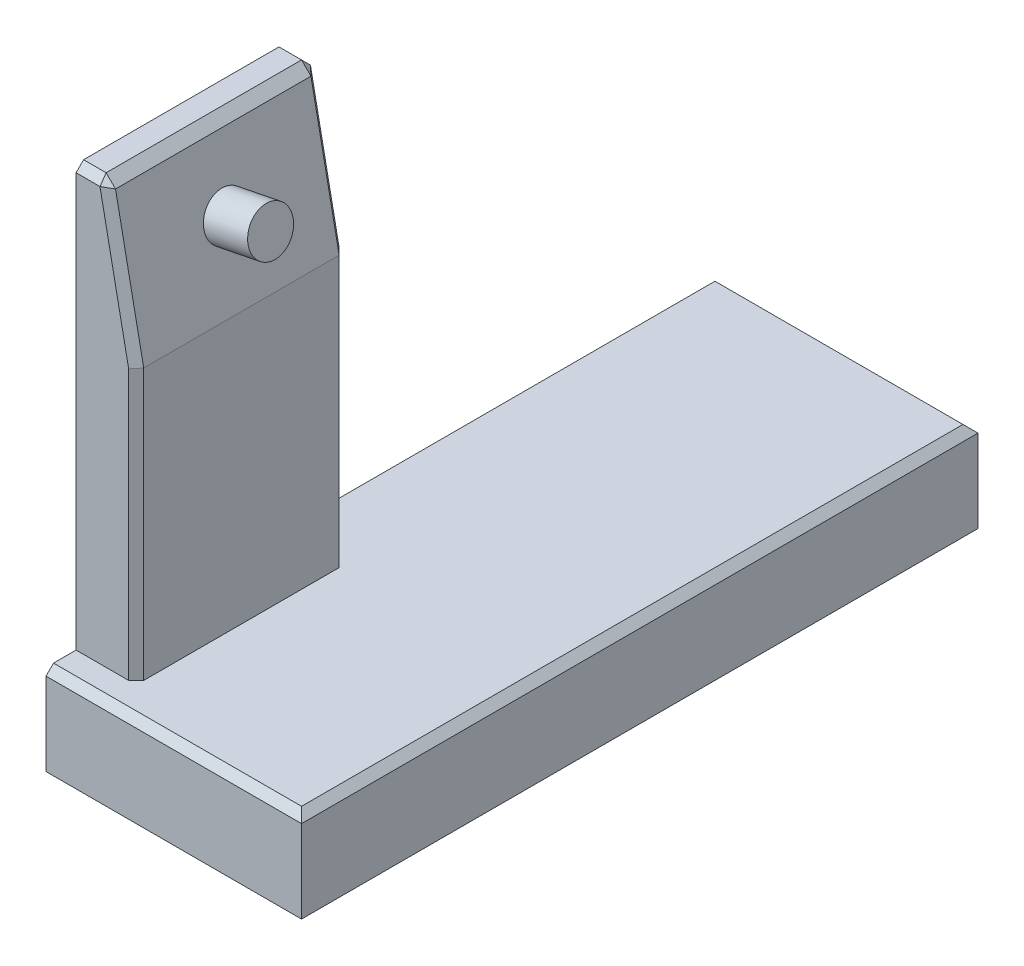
ISO-10303-21;
HEADER;
FILE_DESCRIPTION(('STEP AP214'),'2;1');
FILE_NAME('part.step','',(''),(''),'','','');
FILE_SCHEMA(('AUTOMOTIVE_DESIGN { 1 0 10303 214 1 1 1 1 }'));
ENDSEC;
DATA;
#1=APPLICATION_CONTEXT('core data for automotive mechanical design processes');
#2=APPLICATION_PROTOCOL_DEFINITION('international standard','automotive_design',2000,#1);
#3=PRODUCT_CONTEXT('',#1,'mechanical');
#4=PRODUCT('Part','Part','',(#3));
#5=PRODUCT_RELATED_PRODUCT_CATEGORY('part','',(#4));
#6=PRODUCT_DEFINITION_FORMATION('','',#4);
#7=PRODUCT_DEFINITION_CONTEXT('part definition',#1,'design');
#8=PRODUCT_DEFINITION('design','',#6,#7);
#9=PRODUCT_DEFINITION_SHAPE('','',#8);
#10=(LENGTH_UNIT() NAMED_UNIT(*) SI_UNIT(.MILLI.,.METRE.));
#11=(NAMED_UNIT(*) PLANE_ANGLE_UNIT() SI_UNIT($,.RADIAN.));
#12=(NAMED_UNIT(*) SI_UNIT($,.STERADIAN.) SOLID_ANGLE_UNIT());
#13=UNCERTAINTY_MEASURE_WITH_UNIT(LENGTH_MEASURE(1.E-05),#10,'distance_accuracy_value','');
#14=(GEOMETRIC_REPRESENTATION_CONTEXT(3) GLOBAL_UNCERTAINTY_ASSIGNED_CONTEXT((#13)) GLOBAL_UNIT_ASSIGNED_CONTEXT((#10,
#11,#12)) REPRESENTATION_CONTEXT('',''));
#15=CARTESIAN_POINT('',(0.,0.,0.));
#16=DIRECTION('',(0.,0.,1.));
#17=DIRECTION('',(1.,0.,0.));
#18=AXIS2_PLACEMENT_3D('',#15,#16,#17);
#19=CARTESIAN_POINT('',(0.,6.,0.));
#20=DIRECTION('',(0.,-1.,0.));
#21=DIRECTION('',(0.,0.,-1.));
#22=AXIS2_PLACEMENT_3D('',#19,#20,#21);
#23=PLANE('',#22);
#24=DIRECTION('',(0.,0.,1.));
#25=VECTOR('',#24,1.);
#26=CARTESIAN_POINT('',(0.,6.,0.));
#27=LINE('',#26,#25);
#28=CARTESIAN_POINT('',(0.,6.,-2.));
#29=VERTEX_POINT('',#28);
#30=CARTESIAN_POINT('',(0.,6.,-0.5));
#31=VERTEX_POINT('',#30);
#32=EDGE_CURVE('E183',#29,#31,#27,.T.);
#33=ORIENTED_EDGE('',*,*,#32,.T.);
#34=DIRECTION('',(1.,0.,0.));
#35=VECTOR('',#34,1.);
#36=CARTESIAN_POINT('',(0.,6.,-0.5));
#37=LINE('',#36,#35);
#38=CARTESIAN_POINT('',(16.5,6.,-0.5));
#39=VERTEX_POINT('',#38);
#40=EDGE_CURVE('E229',#31,#39,#37,.T.);
#41=ORIENTED_EDGE('',*,*,#40,.T.);
#42=DIRECTION('',(0.,0.,-1.));
#43=VECTOR('',#42,1.);
#44=CARTESIAN_POINT('',(16.5,6.,0.));
#45=LINE('',#44,#43);
#46=CARTESIAN_POINT('',(16.5,6.,-44.5));
#47=VERTEX_POINT('',#46);
#48=EDGE_CURVE('E225',#39,#47,#45,.T.);
#49=ORIENTED_EDGE('',*,*,#48,.T.);
#50=DIRECTION('',(-1.,0.,0.));
#51=VECTOR('',#50,1.);
#52=CARTESIAN_POINT('',(0.,6.,-44.5));
#53=LINE('',#52,#51);
#54=CARTESIAN_POINT('',(0.,6.,-44.5));
#55=VERTEX_POINT('',#54);
#56=EDGE_CURVE('E227',#47,#55,#53,.T.);
#57=ORIENTED_EDGE('',*,*,#56,.T.);
#58=CARTESIAN_POINT('',(0.,6.,-16.));
#59=VERTEX_POINT('',#58);
#60=EDGE_CURVE('E178',#55,#59,#27,.T.);
#61=ORIENTED_EDGE('',*,*,#60,.T.);
#62=DIRECTION('',(-1.,0.,0.));
#63=VECTOR('',#62,1.);
#64=CARTESIAN_POINT('',(0.,6.,-16.));
#65=LINE('',#64,#63);
#66=CARTESIAN_POINT('',(3.5,6.,-16.));
#67=VERTEX_POINT('',#66);
#68=EDGE_CURVE('E361',#67,#59,#65,.T.);
#69=ORIENTED_EDGE('',*,*,#68,.F.);
#70=DIRECTION('',(-0.707106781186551,0.,-0.707106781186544));
#71=VECTOR('',#70,1.);
#72=CARTESIAN_POINT('',(9.74999999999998,6.,-9.75000000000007));
#73=LINE('',#72,#71);
#74=CARTESIAN_POINT('',(4.,6.,-15.5));
#75=VERTEX_POINT('',#74);
#76=EDGE_CURVE('E42',#67,#75,#73,.F.);
#77=ORIENTED_EDGE('',*,*,#76,.T.);
#78=DIRECTION('',(0.,0.,-1.));
#79=VECTOR('',#78,1.);
#80=CARTESIAN_POINT('',(4.,6.,-2.));
#81=LINE('',#80,#79);
#82=CARTESIAN_POINT('',(4.,6.,-2.49999999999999));
#83=VERTEX_POINT('',#82);
#84=EDGE_CURVE('E359',#83,#75,#81,.T.);
#85=ORIENTED_EDGE('',*,*,#84,.F.);
#86=DIRECTION('',(0.707106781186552,0.,-0.707106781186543));
#87=VECTOR('',#86,1.);
#88=CARTESIAN_POINT('',(0.749999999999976,6.,0.749999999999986));
#89=LINE('',#88,#87);
#90=CARTESIAN_POINT('',(3.5,6.,-2.));
#91=VERTEX_POINT('',#90);
#92=EDGE_CURVE('E11',#83,#91,#89,.F.);
#93=ORIENTED_EDGE('',*,*,#92,.T.);
#94=DIRECTION('',(1.,0.,0.));
#95=VECTOR('',#94,1.);
#96=CARTESIAN_POINT('',(0.,6.,-2.));
#97=LINE('',#96,#95);
#98=EDGE_CURVE('E281',#29,#91,#97,.T.);
#99=ORIENTED_EDGE('',*,*,#98,.F.);
#100=EDGE_LOOP('',(#33,#41,#49,#57,#61,#69,#77,#85,#93,#99));
#101=FACE_BOUND('',#100,.T.);
#102=ADVANCED_FACE('F33',(#101),#23,.F.);
#103=CARTESIAN_POINT('',(0.,6.,0.));
#104=DIRECTION('',(1.,0.,0.));
#105=DIRECTION('',(0.,0.,-1.));
#106=AXIS2_PLACEMENT_3D('',#103,#104,#105);
#107=PLANE('',#106);
#108=DIRECTION('',(0.,0.,1.));
#109=VECTOR('',#108,1.);
#110=CARTESIAN_POINT('',(0.,34.,-2.));
#111=LINE('',#110,#109);
#112=CARTESIAN_POINT('',(0.,34.,-15.5));
#113=VERTEX_POINT('',#112);
#114=CARTESIAN_POINT('',(0.,34.,-2.49999999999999));
#115=VERTEX_POINT('',#114);
#116=EDGE_CURVE('E368',#113,#115,#111,.T.);
#117=ORIENTED_EDGE('',*,*,#116,.F.);
#118=DIRECTION('',(0.,0.707106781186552,0.707106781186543));
#119=VECTOR('',#118,1.);
#120=CARTESIAN_POINT('',(0.,34.,-15.5));
#121=LINE('',#120,#119);
#122=CARTESIAN_POINT('',(0.,33.5,-16.));
#123=VERTEX_POINT('',#122);
#124=EDGE_CURVE('E207',#113,#123,#121,.F.);
#125=ORIENTED_EDGE('',*,*,#124,.T.);
#126=DIRECTION('',(0.,-1.,0.));
#127=VECTOR('',#126,1.);
#128=CARTESIAN_POINT('',(0.,34.,-16.));
#129=LINE('',#128,#127);
#130=EDGE_CURVE('E175',#123,#59,#129,.T.);
#131=ORIENTED_EDGE('',*,*,#130,.T.);
#132=ORIENTED_EDGE('',*,*,#60,.F.);
#133=DIRECTION('',(0.,0.707106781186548,0.707106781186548));
#134=VECTOR('',#133,1.);
#135=CARTESIAN_POINT('',(0.,6.,-44.5));
#136=LINE('',#135,#134);
#137=CARTESIAN_POINT('',(0.,5.5,-45.));
#138=VERTEX_POINT('',#137);
#139=EDGE_CURVE('E201',#55,#138,#136,.F.);
#140=ORIENTED_EDGE('',*,*,#139,.T.);
#141=DIRECTION('',(0.,-1.,0.));
#142=VECTOR('',#141,1.);
#143=CARTESIAN_POINT('',(0.,6.,-45.));
#144=LINE('',#143,#142);
#145=CARTESIAN_POINT('',(0.,0.,-45.));
#146=VERTEX_POINT('',#145);
#147=EDGE_CURVE('E171',#138,#146,#144,.T.);
#148=ORIENTED_EDGE('',*,*,#147,.T.);
#149=DIRECTION('',(0.,0.,1.));
#150=VECTOR('',#149,1.);
#151=CARTESIAN_POINT('',(0.,0.,0.));
#152=LINE('',#151,#150);
#153=CARTESIAN_POINT('',(0.,0.,0.));
#154=VERTEX_POINT('',#153);
#155=EDGE_CURVE('E165',#146,#154,#152,.T.);
#156=ORIENTED_EDGE('',*,*,#155,.T.);
#157=DIRECTION('',(0.,-1.,0.));
#158=VECTOR('',#157,1.);
#159=CARTESIAN_POINT('',(0.,6.,0.));
#160=LINE('',#159,#158);
#161=CARTESIAN_POINT('',(0.,5.5,0.));
#162=VERTEX_POINT('',#161);
#163=EDGE_CURVE('E148',#162,#154,#160,.T.);
#164=ORIENTED_EDGE('',*,*,#163,.F.);
#165=DIRECTION('',(0.,-0.707106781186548,0.707106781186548));
#166=VECTOR('',#165,1.);
#167=CARTESIAN_POINT('',(0.,6.,-0.5));
#168=LINE('',#167,#166);
#169=EDGE_CURVE('E203',#162,#31,#168,.F.);
#170=ORIENTED_EDGE('',*,*,#169,.T.);
#171=ORIENTED_EDGE('',*,*,#32,.F.);
#172=DIRECTION('',(0.,-1.,0.));
#173=VECTOR('',#172,1.);
#174=CARTESIAN_POINT('',(0.,34.,-2.));
#175=LINE('',#174,#173);
#176=CARTESIAN_POINT('',(0.,33.5,-2.));
#177=VERTEX_POINT('',#176);
#178=EDGE_CURVE('E173',#177,#29,#175,.T.);
#179=ORIENTED_EDGE('',*,*,#178,.F.);
#180=DIRECTION('',(0.,-0.707106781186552,0.707106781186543));
#181=VECTOR('',#180,1.);
#182=CARTESIAN_POINT('',(0.,34.,-2.49999999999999));
#183=LINE('',#182,#181);
#184=EDGE_CURVE('E205',#177,#115,#183,.F.);
#185=ORIENTED_EDGE('',*,*,#184,.T.);
#186=EDGE_LOOP('',(#117,#125,#131,#132,#140,#148,#156,#164,#170,#171,#179,#185));
#187=FACE_BOUND('',#186,.T.);
#188=ADVANCED_FACE('F170',(#187),#107,.F.);
#189=CARTESIAN_POINT('',(0.,6.,0.));
#190=DIRECTION('',(0.,0.,-1.));
#191=DIRECTION('',(-1.,0.,0.));
#192=AXIS2_PLACEMENT_3D('',#189,#190,#191);
#193=PLANE('',#192);
#194=DIRECTION('',(0.,-1.,0.));
#195=VECTOR('',#194,1.);
#196=CARTESIAN_POINT('',(17.,6.,0.));
#197=LINE('',#196,#195);
#198=CARTESIAN_POINT('',(17.,5.5,0.));
#199=VERTEX_POINT('',#198);
#200=CARTESIAN_POINT('',(17.,0.,0.));
#201=VERTEX_POINT('',#200);
#202=EDGE_CURVE('E159',#199,#201,#197,.T.);
#203=ORIENTED_EDGE('',*,*,#202,.F.);
#204=DIRECTION('',(-1.,0.,0.));
#205=VECTOR('',#204,1.);
#206=CARTESIAN_POINT('',(0.,5.5,0.));
#207=LINE('',#206,#205);
#208=EDGE_CURVE('E154',#199,#162,#207,.T.);
#209=ORIENTED_EDGE('',*,*,#208,.T.);
#210=ORIENTED_EDGE('',*,*,#163,.T.);
#211=DIRECTION('',(1.,0.,0.));
#212=VECTOR('',#211,1.);
#213=CARTESIAN_POINT('',(0.,0.,0.));
#214=LINE('',#213,#212);
#215=EDGE_CURVE('E151',#154,#201,#214,.T.);
#216=ORIENTED_EDGE('',*,*,#215,.T.);
#217=EDGE_LOOP('',(#203,#209,#210,#216));
#218=FACE_BOUND('',#217,.T.);
#219=ADVANCED_FACE('F150',(#218),#193,.F.);
#220=CARTESIAN_POINT('',(17.,6.,0.));
#221=DIRECTION('',(-1.,0.,0.));
#222=DIRECTION('',(0.,0.,1.));
#223=AXIS2_PLACEMENT_3D('',#220,#221,#222);
#224=PLANE('',#223);
#225=DIRECTION('',(0.,-1.,0.));
#226=VECTOR('',#225,1.);
#227=CARTESIAN_POINT('',(17.,6.,-45.));
#228=LINE('',#227,#226);
#229=CARTESIAN_POINT('',(17.,5.5,-45.));
#230=VERTEX_POINT('',#229);
#231=CARTESIAN_POINT('',(17.,0.,-45.));
#232=VERTEX_POINT('',#231);
#233=EDGE_CURVE('E185',#230,#232,#228,.T.);
#234=ORIENTED_EDGE('',*,*,#233,.F.);
#235=DIRECTION('',(0.,0.,1.));
#236=VECTOR('',#235,1.);
#237=CARTESIAN_POINT('',(17.,5.5,0.));
#238=LINE('',#237,#236);
#239=EDGE_CURVE('E57',#230,#199,#238,.T.);
#240=ORIENTED_EDGE('',*,*,#239,.T.);
#241=ORIENTED_EDGE('',*,*,#202,.T.);
#242=DIRECTION('',(0.,0.,-1.));
#243=VECTOR('',#242,1.);
#244=CARTESIAN_POINT('',(17.,0.,0.));
#245=LINE('',#244,#243);
#246=EDGE_CURVE('E167',#201,#232,#245,.T.);
#247=ORIENTED_EDGE('',*,*,#246,.T.);
#248=EDGE_LOOP('',(#234,#240,#241,#247));
#249=FACE_BOUND('',#248,.T.);
#250=ADVANCED_FACE('F307',(#249),#224,.F.);
#251=CARTESIAN_POINT('',(0.,6.,-45.));
#252=DIRECTION('',(0.,0.,1.));
#253=DIRECTION('',(1.,0.,0.));
#254=AXIS2_PLACEMENT_3D('',#251,#252,#253);
#255=PLANE('',#254);
#256=ORIENTED_EDGE('',*,*,#147,.F.);
#257=DIRECTION('',(1.,0.,0.));
#258=VECTOR('',#257,1.);
#259=CARTESIAN_POINT('',(0.,5.5,-45.));
#260=LINE('',#259,#258);
#261=EDGE_CURVE('E50',#138,#230,#260,.T.);
#262=ORIENTED_EDGE('',*,*,#261,.T.);
#263=ORIENTED_EDGE('',*,*,#233,.T.);
#264=DIRECTION('',(-1.,0.,0.));
#265=VECTOR('',#264,1.);
#266=CARTESIAN_POINT('',(0.,0.,-45.));
#267=LINE('',#266,#265);
#268=EDGE_CURVE('E181',#232,#146,#267,.T.);
#269=ORIENTED_EDGE('',*,*,#268,.T.);
#270=EDGE_LOOP('',(#256,#262,#263,#269));
#271=FACE_BOUND('',#270,.T.);
#272=ADVANCED_FACE('F303',(#271),#255,.F.);
#273=CARTESIAN_POINT('',(0.,0.,0.));
#274=DIRECTION('',(0.,-1.,0.));
#275=DIRECTION('',(0.,0.,-1.));
#276=AXIS2_PLACEMENT_3D('',#273,#274,#275);
#277=PLANE('',#276);
#278=CARTESIAN_POINT('',(9.,0.,-11.25));
#279=DIRECTION('',(0.,-1.,0.));
#280=DIRECTION('',(0.,0.,-1.));
#281=AXIS2_PLACEMENT_3D('',#278,#279,#280);
#282=CIRCLE('',#281,4.);
#283=CARTESIAN_POINT('',(9.,0.,-15.25));
#284=VERTEX_POINT('',#283);
#285=EDGE_CURVE('E386',#284,#284,#282,.T.);
#286=ORIENTED_EDGE('',*,*,#285,.F.);
#287=EDGE_LOOP('',(#286));
#288=FACE_BOUND('',#287,.T.);
#289=CARTESIAN_POINT('',(9.00000000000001,0.,-33.75));
#290=DIRECTION('',(0.,-1.,0.));
#291=DIRECTION('',(0.,0.,-1.));
#292=AXIS2_PLACEMENT_3D('',#289,#290,#291);
#293=CIRCLE('',#292,4.);
#294=CARTESIAN_POINT('',(9.00000000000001,0.,-37.75));
#295=VERTEX_POINT('',#294);
#296=EDGE_CURVE('E380',#295,#295,#293,.T.);
#297=ORIENTED_EDGE('',*,*,#296,.F.);
#298=EDGE_LOOP('',(#297));
#299=FACE_BOUND('',#298,.T.);
#300=ORIENTED_EDGE('',*,*,#155,.F.);
#301=ORIENTED_EDGE('',*,*,#268,.F.);
#302=ORIENTED_EDGE('',*,*,#246,.F.);
#303=ORIENTED_EDGE('',*,*,#215,.F.);
#304=EDGE_LOOP('',(#300,#301,#302,#303));
#305=FACE_BOUND('',#304,.T.);
#306=ADVANCED_FACE('F163',(#288,#299,#305),#277,.T.);
#307=CARTESIAN_POINT('',(0.,34.,-2.));
#308=DIRECTION('',(0.,0.,-1.));
#309=DIRECTION('',(-1.,0.,0.));
#310=AXIS2_PLACEMENT_3D('',#307,#308,#309);
#311=PLANE('',#310);
#312=DIRECTION('',(-0.196116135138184,0.98058067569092,0.));
#313=VECTOR('',#312,1.);
#314=CARTESIAN_POINT('',(1.43278658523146,34.2865573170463,-2.));
#315=LINE('',#314,#313);
#316=CARTESIAN_POINT('',(3.5,23.9504902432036,-2.));
#317=VERTEX_POINT('',#316);
#318=CARTESIAN_POINT('',(1.59009804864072,33.5,-2.));
#319=VERTEX_POINT('',#318);
#320=EDGE_CURVE('E221',#317,#319,#315,.T.);
#321=ORIENTED_EDGE('',*,*,#320,.T.);
#322=DIRECTION('',(-1.,0.,0.));
#323=VECTOR('',#322,1.);
#324=CARTESIAN_POINT('',(0.,33.5,-2.));
#325=LINE('',#324,#323);
#326=EDGE_CURVE('E223',#319,#177,#325,.T.);
#327=ORIENTED_EDGE('',*,*,#326,.T.);
#328=ORIENTED_EDGE('',*,*,#178,.T.);
#329=ORIENTED_EDGE('',*,*,#98,.T.);
#330=DIRECTION('',(0.,1.,0.));
#331=VECTOR('',#330,1.);
#332=CARTESIAN_POINT('',(3.5,34.,-2.));
#333=LINE('',#332,#331);
#334=EDGE_CURVE('E219',#91,#317,#333,.T.);
#335=ORIENTED_EDGE('',*,*,#334,.T.);
#336=EDGE_LOOP('',(#321,#327,#328,#329,#335));
#337=FACE_BOUND('',#336,.T.);
#338=ADVANCED_FACE('F299',(#337),#311,.F.);
#339=CARTESIAN_POINT('',(4.,34.,-2.));
#340=DIRECTION('',(-1.,0.,0.));
#341=DIRECTION('',(0.,0.,1.));
#342=AXIS2_PLACEMENT_3D('',#339,#340,#341);
#343=PLANE('',#342);
#344=ORIENTED_EDGE('',*,*,#84,.T.);
#345=DIRECTION('',(0.,1.,0.));
#346=VECTOR('',#345,1.);
#347=CARTESIAN_POINT('',(4.,34.,-15.5));
#348=LINE('',#347,#346);
#349=CARTESIAN_POINT('',(4.,24.,-15.5));
#350=VERTEX_POINT('',#349);
#351=EDGE_CURVE('E217',#75,#350,#348,.T.);
#352=ORIENTED_EDGE('',*,*,#351,.T.);
#353=DIRECTION('',(0.,0.,1.));
#354=VECTOR('',#353,1.);
#355=CARTESIAN_POINT('',(4.,24.,-16.));
#356=LINE('',#355,#354);
#357=CARTESIAN_POINT('',(4.,24.,-2.49999999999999));
#358=VERTEX_POINT('',#357);
#359=EDGE_CURVE('E370',#350,#358,#356,.T.);
#360=ORIENTED_EDGE('',*,*,#359,.T.);
#361=DIRECTION('',(0.,-1.,0.));
#362=VECTOR('',#361,1.);
#363=CARTESIAN_POINT('',(4.,34.,-2.49999999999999));
#364=LINE('',#363,#362);
#365=EDGE_CURVE('E215',#358,#83,#364,.T.);
#366=ORIENTED_EDGE('',*,*,#365,.T.);
#367=EDGE_LOOP('',(#344,#352,#360,#366));
#368=FACE_BOUND('',#367,.T.);
#369=ADVANCED_FACE('F363',(#368),#343,.F.);
#370=CARTESIAN_POINT('',(0.,34.,-16.));
#371=DIRECTION('',(0.,0.,1.));
#372=DIRECTION('',(1.,0.,0.));
#373=AXIS2_PLACEMENT_3D('',#370,#371,#372);
#374=PLANE('',#373);
#375=ORIENTED_EDGE('',*,*,#130,.F.);
#376=DIRECTION('',(1.,0.,0.));
#377=VECTOR('',#376,1.);
#378=CARTESIAN_POINT('',(0.,33.5,-16.));
#379=LINE('',#378,#377);
#380=CARTESIAN_POINT('',(1.59009804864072,33.5,-16.));
#381=VERTEX_POINT('',#380);
#382=EDGE_CURVE('E213',#123,#381,#379,.T.);
#383=ORIENTED_EDGE('',*,*,#382,.T.);
#384=DIRECTION('',(0.196116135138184,-0.98058067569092,0.));
#385=VECTOR('',#384,1.);
#386=CARTESIAN_POINT('',(1.43278658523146,34.2865573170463,-16.));
#387=LINE('',#386,#385);
#388=CARTESIAN_POINT('',(3.49999999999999,23.9504902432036,-16.));
#389=VERTEX_POINT('',#388);
#390=EDGE_CURVE('E209',#381,#389,#387,.T.);
#391=ORIENTED_EDGE('',*,*,#390,.T.);
#392=DIRECTION('',(0.,-1.,0.));
#393=VECTOR('',#392,1.);
#394=CARTESIAN_POINT('',(3.5,34.,-16.));
#395=LINE('',#394,#393);
#396=EDGE_CURVE('E211',#389,#67,#395,.T.);
#397=ORIENTED_EDGE('',*,*,#396,.T.);
#398=ORIENTED_EDGE('',*,*,#68,.T.);
#399=EDGE_LOOP('',(#375,#383,#391,#397,#398));
#400=FACE_BOUND('',#399,.T.);
#401=ADVANCED_FACE('F429',(#400),#374,.F.);
#402=CARTESIAN_POINT('',(0.,34.,0.));
#403=DIRECTION('',(0.,-1.,0.));
#404=DIRECTION('',(0.,0.,-1.));
#405=AXIS2_PLACEMENT_3D('',#402,#403,#404);
#406=PLANE('',#405);
#407=DIRECTION('',(0.,0.,-1.));
#408=VECTOR('',#407,1.);
#409=CARTESIAN_POINT('',(1.50000000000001,34.,0.));
#410=LINE('',#409,#408);
#411=CARTESIAN_POINT('',(1.50000000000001,34.,-2.49999999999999));
#412=VERTEX_POINT('',#411);
#413=CARTESIAN_POINT('',(1.50000000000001,34.,-15.5));
#414=VERTEX_POINT('',#413);
#415=EDGE_CURVE('E197',#412,#414,#410,.T.);
#416=ORIENTED_EDGE('',*,*,#415,.T.);
#417=DIRECTION('',(-1.,0.,0.));
#418=VECTOR('',#417,1.);
#419=CARTESIAN_POINT('',(0.,34.,-15.5));
#420=LINE('',#419,#418);
#421=EDGE_CURVE('E199',#414,#113,#420,.T.);
#422=ORIENTED_EDGE('',*,*,#421,.T.);
#423=ORIENTED_EDGE('',*,*,#116,.T.);
#424=DIRECTION('',(1.,0.,0.));
#425=VECTOR('',#424,1.);
#426=CARTESIAN_POINT('',(0.,34.,-2.49999999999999));
#427=LINE('',#426,#425);
#428=EDGE_CURVE('E195',#115,#412,#427,.T.);
#429=ORIENTED_EDGE('',*,*,#428,.T.);
#430=EDGE_LOOP('',(#416,#422,#423,#429));
#431=FACE_BOUND('',#430,.T.);
#432=ADVANCED_FACE('F406',(#431),#406,.F.);
#433=CARTESIAN_POINT('',(2.,34.,-16.));
#434=DIRECTION('',(-0.98058067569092,-0.196116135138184,0.));
#435=DIRECTION('',(0.196116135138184,-0.98058067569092,0.));
#436=AXIS2_PLACEMENT_3D('',#433,#434,#435);
#437=PLANE('',#436);
#438=CARTESIAN_POINT('',(3.,29.,-9.));
#439=DIRECTION('',(0.98058067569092,0.196116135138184,0.));
#440=DIRECTION('',(-0.196116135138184,0.98058067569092,0.));
#441=AXIS2_PLACEMENT_3D('',#438,#439,#440);
#442=CIRCLE('',#441,1.5);
#443=CARTESIAN_POINT('',(2.70582579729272,30.4708710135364,-9.));
#444=VERTEX_POINT('',#443);
#445=EDGE_CURVE('E158',#444,#444,#442,.T.);
#446=ORIENTED_EDGE('',*,*,#445,.F.);
#447=EDGE_LOOP('',(#446));
#448=FACE_BOUND('',#447,.T.);
#449=ORIENTED_EDGE('',*,*,#359,.F.);
#450=DIRECTION('',(-0.196116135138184,0.98058067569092,0.));
#451=VECTOR('',#450,1.);
#452=CARTESIAN_POINT('',(2.,34.,-15.5));
#453=LINE('',#452,#451);
#454=CARTESIAN_POINT('',(2.125,33.375,-15.5));
#455=VERTEX_POINT('',#454);
#456=EDGE_CURVE('E193',#350,#455,#453,.T.);
#457=ORIENTED_EDGE('',*,*,#456,.T.);
#458=DIRECTION('',(0.,0.,1.));
#459=VECTOR('',#458,1.);
#460=CARTESIAN_POINT('',(2.125,33.375,-16.));
#461=LINE('',#460,#459);
#462=CARTESIAN_POINT('',(2.125,33.375,-2.49999999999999));
#463=VERTEX_POINT('',#462);
#464=EDGE_CURVE('E190',#455,#463,#461,.T.);
#465=ORIENTED_EDGE('',*,*,#464,.T.);
#466=DIRECTION('',(0.196116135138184,-0.98058067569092,0.));
#467=VECTOR('',#466,1.);
#468=CARTESIAN_POINT('',(2.,34.,-2.49999999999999));
#469=LINE('',#468,#467);
#470=EDGE_CURVE('E188',#463,#358,#469,.T.);
#471=ORIENTED_EDGE('',*,*,#470,.T.);
#472=EDGE_LOOP('',(#449,#457,#465,#471));
#473=FACE_BOUND('',#472,.T.);
#474=ADVANCED_FACE('F402',(#448,#473),#437,.F.);
#475=CARTESIAN_POINT('',(9.00000000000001,5.,-33.75));
#476=DIRECTION('',(0.,-1.,0.));
#477=DIRECTION('',(0.,0.,-1.));
#478=AXIS2_PLACEMENT_3D('',#475,#476,#477);
#479=CYLINDRICAL_SURFACE('',#478,4.);
#480=CARTESIAN_POINT('',(9.00000000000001,5.,-33.75));
#481=DIRECTION('',(0.,-1.,0.));
#482=DIRECTION('',(0.,0.,-1.));
#483=AXIS2_PLACEMENT_3D('',#480,#481,#482);
#484=CIRCLE('',#483,4.);
#485=CARTESIAN_POINT('',(9.00000000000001,5.,-37.75));
#486=VERTEX_POINT('',#485);
#487=EDGE_CURVE('E383',#486,#486,#484,.T.);
#488=ORIENTED_EDGE('',*,*,#487,.F.);
#489=EDGE_LOOP('',(#488));
#490=FACE_BOUND('',#489,.T.);
#491=ORIENTED_EDGE('',*,*,#296,.T.);
#492=EDGE_LOOP('',(#491));
#493=FACE_BOUND('',#492,.T.);
#494=ADVANCED_FACE('F405',(#490,#493),#479,.F.);
#495=CARTESIAN_POINT('',(9.00000000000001,5.,-33.75));
#496=DIRECTION('',(0.,-1.,0.));
#497=DIRECTION('',(0.,0.,-1.));
#498=AXIS2_PLACEMENT_3D('',#495,#496,#497);
#499=PLANE('',#498);
#500=ORIENTED_EDGE('',*,*,#487,.T.);
#501=EDGE_LOOP('',(#500));
#502=FACE_BOUND('',#501,.T.);
#503=ADVANCED_FACE('F440',(#502),#499,.T.);
#504=CARTESIAN_POINT('',(9.,5.,-11.25));
#505=DIRECTION('',(0.,-1.,0.));
#506=DIRECTION('',(0.,0.,-1.));
#507=AXIS2_PLACEMENT_3D('',#504,#505,#506);
#508=CYLINDRICAL_SURFACE('',#507,4.);
#509=CARTESIAN_POINT('',(9.,5.,-11.25));
#510=DIRECTION('',(0.,-1.,0.));
#511=DIRECTION('',(0.,0.,-1.));
#512=AXIS2_PLACEMENT_3D('',#509,#510,#511);
#513=CIRCLE('',#512,4.);
#514=CARTESIAN_POINT('',(9.,5.,-15.25));
#515=VERTEX_POINT('',#514);
#516=EDGE_CURVE('E379',#515,#515,#513,.T.);
#517=ORIENTED_EDGE('',*,*,#516,.F.);
#518=EDGE_LOOP('',(#517));
#519=FACE_BOUND('',#518,.T.);
#520=ORIENTED_EDGE('',*,*,#285,.T.);
#521=EDGE_LOOP('',(#520));
#522=FACE_BOUND('',#521,.T.);
#523=ADVANCED_FACE('F444',(#519,#522),#508,.F.);
#524=CARTESIAN_POINT('',(9.,5.,-11.25));
#525=DIRECTION('',(0.,-1.,0.));
#526=DIRECTION('',(0.,0.,-1.));
#527=AXIS2_PLACEMENT_3D('',#524,#525,#526);
#528=PLANE('',#527);
#529=ORIENTED_EDGE('',*,*,#516,.T.);
#530=EDGE_LOOP('',(#529));
#531=FACE_BOUND('',#530,.T.);
#532=ADVANCED_FACE('F398',(#531),#528,.T.);
#533=CARTESIAN_POINT('',(5.94174202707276,29.5883484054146,-9.));
#534=DIRECTION('',(-0.98058067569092,-0.196116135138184,0.));
#535=DIRECTION('',(0.196116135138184,-0.98058067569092,0.));
#536=AXIS2_PLACEMENT_3D('',#533,#534,#535);
#537=CYLINDRICAL_SURFACE('',#536,1.5);
#538=CARTESIAN_POINT('',(5.94174202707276,29.5883484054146,-9.));
#539=DIRECTION('',(0.98058067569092,0.196116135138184,0.));
#540=DIRECTION('',(-0.196116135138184,0.98058067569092,0.));
#541=AXIS2_PLACEMENT_3D('',#538,#539,#540);
#542=CIRCLE('',#541,1.5);
#543=CARTESIAN_POINT('',(5.64756782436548,31.0592194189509,-9.));
#544=VERTEX_POINT('',#543);
#545=EDGE_CURVE('E258',#544,#544,#542,.T.);
#546=ORIENTED_EDGE('',*,*,#545,.F.);
#547=EDGE_LOOP('',(#546));
#548=FACE_BOUND('',#547,.T.);
#549=ORIENTED_EDGE('',*,*,#445,.T.);
#550=EDGE_LOOP('',(#549));
#551=FACE_BOUND('',#550,.T.);
#552=ADVANCED_FACE('F350',(#548,#551),#537,.T.);
#553=CARTESIAN_POINT('',(5.94174202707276,29.5883484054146,-9.));
#554=DIRECTION('',(0.98058067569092,0.196116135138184,0.));
#555=DIRECTION('',(-0.196116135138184,0.98058067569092,0.));
#556=AXIS2_PLACEMENT_3D('',#553,#554,#555);
#557=PLANE('',#556);
#558=ORIENTED_EDGE('',*,*,#545,.T.);
#559=EDGE_LOOP('',(#558));
#560=FACE_BOUND('',#559,.T.);
#561=ADVANCED_FACE('F345',(#560),#557,.T.);
#562=CARTESIAN_POINT('',(3.5,34.,-16.));
#563=DIRECTION('',(-0.707106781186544,0.,0.707106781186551));
#564=DIRECTION('',(0.,-1.,0.));
#565=AXIS2_PLACEMENT_3D('',#562,#563,#564);
#566=PLANE('',#565);
#567=ORIENTED_EDGE('',*,*,#76,.F.);
#568=ORIENTED_EDGE('',*,*,#396,.F.);
#569=DIRECTION('',(-0.705379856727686,-0.0698463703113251,-0.70537985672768));
#570=VECTOR('',#569,1.);
#571=CARTESIAN_POINT('',(2.98067541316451,23.8990669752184,-16.5193245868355));
#572=LINE('',#571,#570);
#573=EDGE_CURVE('E256',#350,#389,#572,.T.);
#574=ORIENTED_EDGE('',*,*,#573,.F.);
#575=ORIENTED_EDGE('',*,*,#351,.F.);
#576=EDGE_LOOP('',(#567,#568,#574,#575));
#577=FACE_BOUND('',#576,.T.);
#578=ADVANCED_FACE('F342',(#577),#566,.F.);
#579=CARTESIAN_POINT('',(4.,34.,-2.49999999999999));
#580=DIRECTION('',(-0.707106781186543,0.,-0.707106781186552));
#581=DIRECTION('',(0.,-1.,0.));
#582=AXIS2_PLACEMENT_3D('',#579,#580,#581);
#583=PLANE('',#582);
#584=ORIENTED_EDGE('',*,*,#92,.F.);
#585=ORIENTED_EDGE('',*,*,#365,.F.);
#586=DIRECTION('',(-0.705379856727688,-0.0698463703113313,0.705379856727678));
#587=VECTOR('',#586,1.);
#588=CARTESIAN_POINT('',(4.49268222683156,24.0487851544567,-2.99268222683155));
#589=LINE('',#588,#587);
#590=EDGE_CURVE('E253',#317,#358,#589,.F.);
#591=ORIENTED_EDGE('',*,*,#590,.F.);
#592=ORIENTED_EDGE('',*,*,#334,.F.);
#593=EDGE_LOOP('',(#584,#585,#591,#592));
#594=FACE_BOUND('',#593,.T.);
#595=ADVANCED_FACE('F339',(#594),#583,.F.);
#596=CARTESIAN_POINT('',(0.,34.,-15.5));
#597=DIRECTION('',(0.,-0.707106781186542,0.707106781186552));
#598=DIRECTION('',(-1.,0.,0.));
#599=AXIS2_PLACEMENT_3D('',#596,#597,#598);
#600=PLANE('',#599);
#601=ORIENTED_EDGE('',*,*,#124,.F.);
#602=ORIENTED_EDGE('',*,*,#421,.F.);
#603=DIRECTION('',(0.126395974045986,-0.701435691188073,-0.701435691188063));
#604=VECTOR('',#603,1.);
#605=CARTESIAN_POINT('',(1.50000000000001,34.,-15.5));
#606=LINE('',#605,#604);
#607=EDGE_CURVE('E250',#381,#414,#606,.F.);
#608=ORIENTED_EDGE('',*,*,#607,.F.);
#609=ORIENTED_EDGE('',*,*,#382,.F.);
#610=EDGE_LOOP('',(#601,#602,#608,#609));
#611=FACE_BOUND('',#610,.T.);
#612=ADVANCED_FACE('F335',(#611),#600,.F.);
#613=CARTESIAN_POINT('',(1.43278658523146,34.2865573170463,-16.));
#614=DIRECTION('',(-0.693375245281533,-0.138675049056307,0.707106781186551));
#615=DIRECTION('',(0.196116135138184,-0.98058067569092,0.));
#616=AXIS2_PLACEMENT_3D('',#613,#614,#615);
#617=PLANE('',#616);
#618=ORIENTED_EDGE('',*,*,#573,.T.);
#619=ORIENTED_EDGE('',*,*,#390,.F.);
#620=DIRECTION('',(0.720120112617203,-0.168283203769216,0.673132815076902));
#621=VECTOR('',#620,1.);
#622=CARTESIAN_POINT('',(1.72515181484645,33.4684395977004,-15.8737583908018));
#623=LINE('',#622,#621);
#624=EDGE_CURVE('E247',#455,#381,#623,.F.);
#625=ORIENTED_EDGE('',*,*,#624,.F.);
#626=ORIENTED_EDGE('',*,*,#456,.F.);
#627=EDGE_LOOP('',(#618,#619,#625,#626));
#628=FACE_BOUND('',#627,.T.);
#629=ADVANCED_FACE('F331',(#628),#617,.F.);
#630=CARTESIAN_POINT('',(2.,34.,-2.49999999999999));
#631=DIRECTION('',(-0.693375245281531,-0.138675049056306,-0.707106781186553));
#632=DIRECTION('',(0.196116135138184,-0.98058067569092,0.));
#633=AXIS2_PLACEMENT_3D('',#630,#631,#632);
#634=PLANE('',#633);
#635=ORIENTED_EDGE('',*,*,#590,.T.);
#636=ORIENTED_EDGE('',*,*,#470,.F.);
#637=DIRECTION('',(-0.720120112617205,0.168283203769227,0.673132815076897));
#638=VECTOR('',#637,1.);
#639=CARTESIAN_POINT('',(2.125,33.375,-2.49999999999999));
#640=LINE('',#639,#638);
#641=EDGE_CURVE('E244',#319,#463,#640,.F.);
#642=ORIENTED_EDGE('',*,*,#641,.F.);
#643=ORIENTED_EDGE('',*,*,#320,.F.);
#644=EDGE_LOOP('',(#635,#636,#642,#643));
#645=FACE_BOUND('',#644,.T.);
#646=ADVANCED_FACE('F327',(#645),#634,.F.);
#647=CARTESIAN_POINT('',(0.,34.,-2.49999999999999));
#648=DIRECTION('',(0.,-0.707106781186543,-0.707106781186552));
#649=DIRECTION('',(1.,0.,0.));
#650=AXIS2_PLACEMENT_3D('',#647,#648,#649);
#651=PLANE('',#650);
#652=ORIENTED_EDGE('',*,*,#184,.F.);
#653=ORIENTED_EDGE('',*,*,#326,.F.);
#654=DIRECTION('',(-0.126395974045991,0.701435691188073,-0.701435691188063));
#655=VECTOR('',#654,1.);
#656=CARTESIAN_POINT('',(1.56539661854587,33.6370808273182,-2.13708082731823));
#657=LINE('',#656,#655);
#658=EDGE_CURVE('E241',#412,#319,#657,.F.);
#659=ORIENTED_EDGE('',*,*,#658,.F.);
#660=ORIENTED_EDGE('',*,*,#428,.F.);
#661=EDGE_LOOP('',(#652,#653,#659,#660));
#662=FACE_BOUND('',#661,.T.);
#663=ADVANCED_FACE('F323',(#662),#651,.F.);
#664=CARTESIAN_POINT('',(1.50000000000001,34.,-15.5));
#665=DIRECTION('',(0.611752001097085,0.611752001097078,-0.501516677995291));
#666=DIRECTION('',(-0.707106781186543,0.707106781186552,0.));
#667=AXIS2_PLACEMENT_3D('',#664,#665,#666);
#668=PLANE('',#667);
#669=ORIENTED_EDGE('',*,*,#624,.T.);
#670=ORIENTED_EDGE('',*,*,#607,.T.);
#671=DIRECTION('',(-0.707106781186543,0.707106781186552,0.));
#672=VECTOR('',#671,1.);
#673=CARTESIAN_POINT('',(1.50000000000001,34.,-15.5));
#674=LINE('',#673,#672);
#675=EDGE_CURVE('E238',#455,#414,#674,.T.);
#676=ORIENTED_EDGE('',*,*,#675,.F.);
#677=EDGE_LOOP('',(#669,#670,#676));
#678=FACE_BOUND('',#677,.T.);
#679=ADVANCED_FACE('F319',(#678),#668,.T.);
#680=CARTESIAN_POINT('',(2.125,33.375,-2.49999999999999));
#681=DIRECTION('',(0.611752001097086,0.611752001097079,0.501516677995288));
#682=DIRECTION('',(-0.707106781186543,0.707106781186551,0.));
#683=AXIS2_PLACEMENT_3D('',#680,#681,#682);
#684=PLANE('',#683);
#685=ORIENTED_EDGE('',*,*,#658,.T.);
#686=ORIENTED_EDGE('',*,*,#641,.T.);
#687=DIRECTION('',(0.707106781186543,-0.707106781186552,0.));
#688=VECTOR('',#687,1.);
#689=CARTESIAN_POINT('',(2.125,33.375,-2.49999999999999));
#690=LINE('',#689,#688);
#691=EDGE_CURVE('E236',#412,#463,#690,.T.);
#692=ORIENTED_EDGE('',*,*,#691,.F.);
#693=EDGE_LOOP('',(#685,#686,#692));
#694=FACE_BOUND('',#693,.T.);
#695=ADVANCED_FACE('F315',(#694),#684,.T.);
#696=CARTESIAN_POINT('',(2.125,33.375,-16.));
#697=DIRECTION('',(-0.707106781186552,-0.707106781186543,0.));
#698=DIRECTION('',(0.,0.,1.));
#699=AXIS2_PLACEMENT_3D('',#696,#697,#698);
#700=PLANE('',#699);
#701=ORIENTED_EDGE('',*,*,#675,.T.);
#702=ORIENTED_EDGE('',*,*,#415,.F.);
#703=ORIENTED_EDGE('',*,*,#691,.T.);
#704=ORIENTED_EDGE('',*,*,#464,.F.);
#705=EDGE_LOOP('',(#701,#702,#703,#704));
#706=FACE_BOUND('',#705,.T.);
#707=ADVANCED_FACE('F312',(#706),#700,.F.);
#708=CARTESIAN_POINT('',(0.,6.,-44.5));
#709=DIRECTION('',(0.,-0.707106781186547,0.707106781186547));
#710=DIRECTION('',(-1.,0.,0.));
#711=AXIS2_PLACEMENT_3D('',#708,#709,#710);
#712=PLANE('',#711);
#713=ORIENTED_EDGE('',*,*,#139,.F.);
#714=ORIENTED_EDGE('',*,*,#56,.F.);
#715=DIRECTION('',(-0.577350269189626,0.577350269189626,0.577350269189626));
#716=VECTOR('',#715,1.);
#717=CARTESIAN_POINT('',(1.66666666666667,20.8333333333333,-29.6666666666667));
#718=LINE('',#717,#716);
#719=EDGE_CURVE('E37',#230,#47,#718,.T.);
#720=ORIENTED_EDGE('',*,*,#719,.F.);
#721=ORIENTED_EDGE('',*,*,#261,.F.);
#722=EDGE_LOOP('',(#713,#714,#720,#721));
#723=FACE_BOUND('',#722,.T.);
#724=ADVANCED_FACE('F35',(#723),#712,.F.);
#725=CARTESIAN_POINT('',(16.5,6.,0.));
#726=DIRECTION('',(-0.707106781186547,-0.707106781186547,0.));
#727=DIRECTION('',(0.,0.,-1.));
#728=AXIS2_PLACEMENT_3D('',#725,#726,#727);
#729=PLANE('',#728);
#730=ORIENTED_EDGE('',*,*,#719,.T.);
#731=ORIENTED_EDGE('',*,*,#48,.F.);
#732=DIRECTION('',(0.577350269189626,-0.577350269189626,0.577350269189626));
#733=VECTOR('',#732,1.);
#734=CARTESIAN_POINT('',(16.6666666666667,5.83333333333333,-0.333333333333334));
#735=LINE('',#734,#733);
#736=EDGE_CURVE('E259',#199,#39,#735,.F.);
#737=ORIENTED_EDGE('',*,*,#736,.F.);
#738=ORIENTED_EDGE('',*,*,#239,.F.);
#739=EDGE_LOOP('',(#730,#731,#737,#738));
#740=FACE_BOUND('',#739,.T.);
#741=ADVANCED_FACE('F267',(#740),#729,.F.);
#742=CARTESIAN_POINT('',(0.,6.,-0.5));
#743=DIRECTION('',(0.,-0.707106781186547,-0.707106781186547));
#744=DIRECTION('',(1.,0.,0.));
#745=AXIS2_PLACEMENT_3D('',#742,#743,#744);
#746=PLANE('',#745);
#747=ORIENTED_EDGE('',*,*,#169,.F.);
#748=ORIENTED_EDGE('',*,*,#208,.F.);
#749=ORIENTED_EDGE('',*,*,#736,.T.);
#750=ORIENTED_EDGE('',*,*,#40,.F.);
#751=EDGE_LOOP('',(#747,#748,#749,#750));
#752=FACE_BOUND('',#751,.T.);
#753=ADVANCED_FACE('F283',(#752),#746,.F.);
#754=CLOSED_SHELL('',(#102,#188,#219,#250,#272,#306,#338,#369,#401,#432,#474,#494,#503,#523,
#532,#552,#561,#578,#595,#612,#629,#646,#663,#679,#695,#707,#724,#741,#753));
#755=MANIFOLD_SOLID_BREP('B2',#754);
#756=ADVANCED_BREP_SHAPE_REPRESENTATION('',(#18,#755),#14);
#757=SHAPE_DEFINITION_REPRESENTATION(#9,#756);
ENDSEC;
END-ISO-10303-21;
